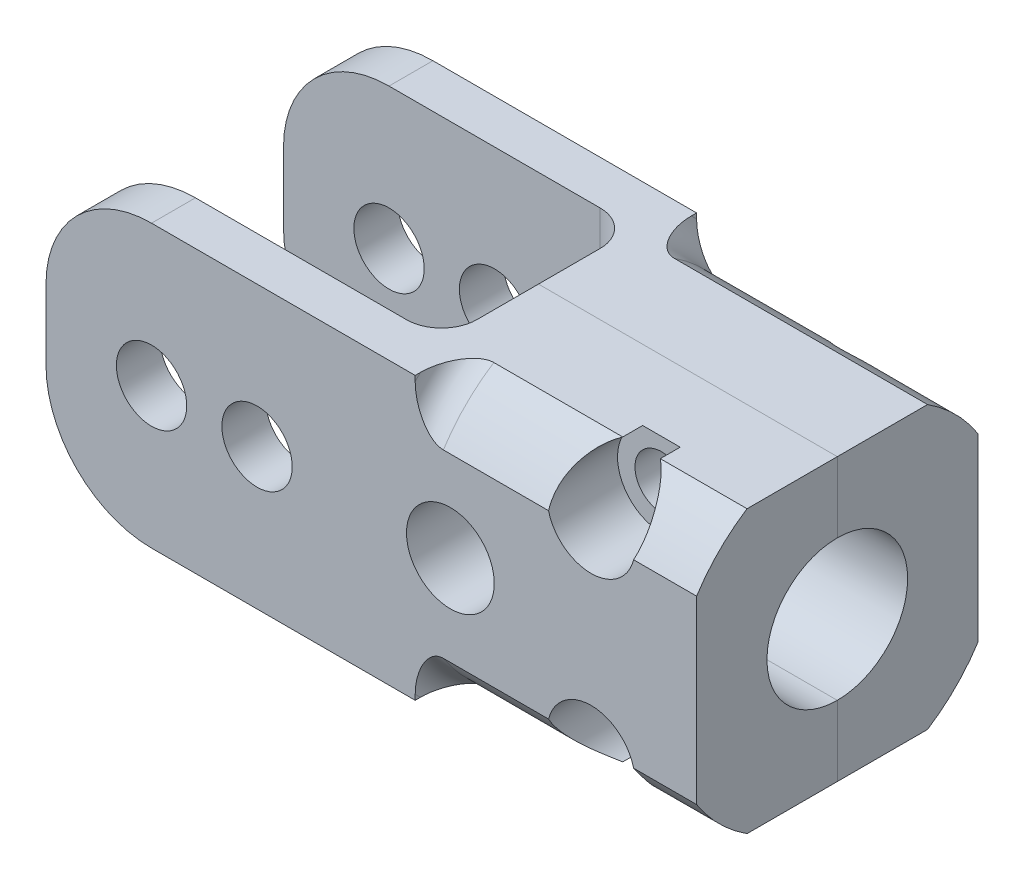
from build123d import *

# Parameters (mm, degrees)
SKETCH2_R           = 3.175
SKETCH2_R_2         = 2.3876
BOSS_EXTRUDE1_DEPTH = 12.7
SKETCH3_R           = 3.175
SKETCH3_R_2         = 2.3876
BOSS_EXTRUDE2_DEPTH = 12.7
CUT_EXTRUDE1_DEPTH  = 25.4
SKETCH6_R           = 3.9624
CUT_EXTRUDE3_DEPTH  = 50.8
CUT_EXTRUDE4_START  = 6.35
SKETCH7_R           = 3.9624
CUT_EXTRUDE4_DEPTH  = 12.7
FILLET2_R           = 3.175
FILLET3_R           = 3.175
SKETCH5_R           = 6.35
CUT_EXTRUDE2_DEPTH  = 50.8
SKETCH8_R           = 3.175
CUT_EXTRUDE5_DEPTH  = 25.4
FILLET4_R           = 9.525
FILLET5_R           = 9.525
SKETCH9_OUTSIDE_W   = 41.168
SKETCH9_OUTSIDE_H   = 41.168
SKETCH9_OUTSIDE_R   = 15.0876
CUT_EXTRUDE6_DEPTH  = 25.4
FILLET7_R           = 2.54
FILLET8_R           = 2.54


with BuildPart() as part:
    # Sketch2 → Boss-Extrude1 (new body)
    with BuildSketch(Plane.XY):
        Polygon((49.1998, -12.7), (0, -12.7), (-9.525, -12.7), (-9.525, 12.7), (0, 12.7), (49.1998, 12.7), (49.1998, 0), align=None)
        Circle(SKETCH2_R, mode=Mode.SUBTRACT)
        with Locations((26.9748, 0)):
            Circle(SKETCH2_R_2, mode=Mode.SUBTRACT)
        with Locations((39.6748, -9.1186)):
            Circle(SKETCH2_R_2, mode=Mode.SUBTRACT)
        with Locations((39.6748, 9.1186)):
            Circle(SKETCH2_R_2, mode=Mode.SUBTRACT)
    extrude(amount=-BOSS_EXTRUDE1_DEPTH)


with BuildPart() as body_2:
    # Sketch3 → Boss-Extrude2 (new body)
    with BuildSketch(Plane.XY):
        Polygon((49.1998, -12.7), (0, -12.7), (-9.525, -12.7), (-9.525, 12.7), (0, 12.7), (49.1998, 12.7), (49.1998, 0), align=None)
        Circle(SKETCH3_R, mode=Mode.SUBTRACT)
        with Locations((26.9748, 0)):
            Circle(SKETCH3_R_2, mode=Mode.SUBTRACT)
        with Locations((39.6748, -9.1186)):
            Circle(SKETCH3_R_2, mode=Mode.SUBTRACT)
        with Locations((39.6748, 9.1186)):
            Circle(SKETCH3_R_2, mode=Mode.SUBTRACT)
    extrude(amount=BOSS_EXTRUDE2_DEPTH)


with BuildPart() as cut_extrude1_tool:
    # Sketch4 → Cut-Extrude1 (new, symmetric)
    with BuildSketch(Plane(origin=(0, 0, 0), x_dir=(1, 0, 0), z_dir=(0, 1, 0))):
        Polygon((22.225, 0), (22.225, -8.7376), (-9.525, -8.7376), (-9.525, 8.7376), (22.225, 8.7376), align=None)
    extrude(amount=CUT_EXTRUDE1_DEPTH, both=True)


with BuildPart() as part_1:
    add(part.part)

    # Cut-Extrude1: cut by cut_extrude1_tool
    add(cut_extrude1_tool.part, mode=Mode.SUBTRACT)

    # Fillet2
    fillet2_edges = [part_1.edges().sort_by_distance(p)[0] for p in [
        (22.225, 0, -8.7376),
    ]]
    fillet(fillet2_edges, radius=FILLET2_R)


with BuildPart() as body_2_1:
    add(body_2.part)

    # Cut-Extrude1: cut by cut_extrude1_tool
    add(cut_extrude1_tool.part, mode=Mode.SUBTRACT)

    # Sketch6 → Cut-Extrude3 (cut)
    with BuildSketch(Plane.XY):
        with Locations(Location((26.9748, 0, 0), (0, 0, 180))):
            Circle(SKETCH6_R)
    extrude(amount=CUT_EXTRUDE3_DEPTH, mode=Mode.SUBTRACT)

    # Sketch7 → Cut-Extrude4 (cut)
    with BuildSketch(Plane.XY.offset(CUT_EXTRUDE4_START)):
        with Locations((39.6748, 9.1186)):
            Circle(SKETCH7_R)
        with Locations((39.6748, -9.1186)):
            Circle(SKETCH7_R)
    extrude(amount=CUT_EXTRUDE4_DEPTH, mode=Mode.SUBTRACT)

    # Fillet3
    fillet3_edges = [body_2_1.edges().sort_by_distance(p)[0] for p in [
        (22.225, 0, 8.7376),
    ]]
    fillet(fillet3_edges, radius=FILLET3_R)


with BuildPart() as cut_extrude2_tool:
    # Sketch5 → Cut-Extrude2 (new body)
    with BuildSketch(Plane(origin=(0, 0, 0), x_dir=(0, 0, -1), z_dir=(1, 0, 0))):
        Circle(SKETCH5_R)
    extrude(amount=CUT_EXTRUDE2_DEPTH)


with BuildPart() as part_2:
    add(part_1.part)

    # Cut-Extrude2: cut by cut_extrude2_tool
    add(cut_extrude2_tool.part, mode=Mode.SUBTRACT)


with BuildPart() as body_2_2:
    add(body_2_1.part)

    # Cut-Extrude2: cut by cut_extrude2_tool
    add(cut_extrude2_tool.part, mode=Mode.SUBTRACT)


with BuildPart() as cut_extrude5_tool:
    # Sketch8 → Cut-Extrude5 (new, symmetric)
    with BuildSketch(Plane.XY):
        with Locations((9.525, 0)):
            Circle(SKETCH8_R)
    extrude(amount=CUT_EXTRUDE5_DEPTH, both=True)


with BuildPart() as part_3:
    add(part_2.part)

    # Cut-Extrude5: cut by cut_extrude5_tool
    add(cut_extrude5_tool.part, mode=Mode.SUBTRACT)

    # Fillet5
    fillet5_edges = [part_3.edges().sort_by_distance(p)[0] for p in [
        (-9.525, -12.7, -10.7188),
        (-9.525, 12.7, -10.7188),
    ]]
    fillet(fillet5_edges, radius=FILLET5_R)


with BuildPart() as body_2_3:
    add(body_2_2.part)

    # Cut-Extrude5: cut by cut_extrude5_tool
    add(cut_extrude5_tool.part, mode=Mode.SUBTRACT)

    # Fillet4
    fillet4_edges = [body_2_3.edges().sort_by_distance(p)[0] for p in [
        (-9.525, -12.7, 10.7188),
        (-9.525, 12.7, 10.7188),
    ]]
    fillet(fillet4_edges, radius=FILLET4_R)


with BuildPart() as cut_extrude6_tool:
    # Sketch9 outside → Cut-Extrude6 (new body)
    with BuildSketch(Plane(origin=(49.1998, 0, 0), x_dir=(0, 0, -1), z_dir=(1, 0, 0))):
        Rectangle(SKETCH9_OUTSIDE_W, SKETCH9_OUTSIDE_H)
        Circle(SKETCH9_OUTSIDE_R, mode=Mode.SUBTRACT)
    extrude(amount=-CUT_EXTRUDE6_DEPTH)


with BuildPart() as part_4:
    add(part_3.part)

    # Cut-Extrude6: cut by cut_extrude6_tool
    add(cut_extrude6_tool.part, mode=Mode.SUBTRACT)

    # Fillet7
    fillet7_edges = [part_4.edges().sort_by_distance(p)[0] for p in [
        (23.7998, 10.668544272, -10.668544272),
        (23.7998, -10.668544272, -10.668544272),
    ]]
    fillet(fillet7_edges, radius=FILLET7_R)


with BuildPart() as body_2_4:
    add(body_2_3.part)

    # Cut-Extrude6: cut by cut_extrude6_tool
    add(cut_extrude6_tool.part, mode=Mode.SUBTRACT)

    # Fillet8
    fillet8_edges = [body_2_4.edges().sort_by_distance(p)[0] for p in [
        (23.7998, -10.668544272, 10.668544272),
        (23.7998, 10.668544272, 10.668544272),
    ]]
    fillet(fillet8_edges, radius=FILLET8_R)


solid = Compound([part_4.part, body_2_4.part])
